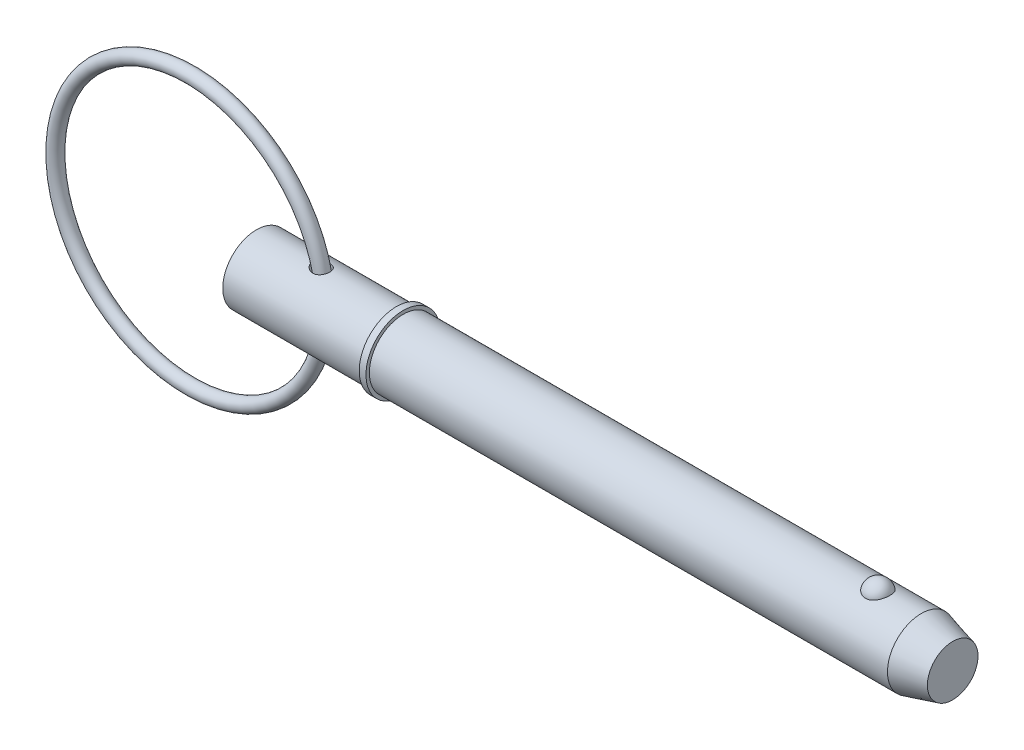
ISO-10303-21;
HEADER;
FILE_DESCRIPTION(('STEP AP214'),'2;1');
FILE_NAME('part.step','',(''),(''),'','','');
FILE_SCHEMA(('AUTOMOTIVE_DESIGN { 1 0 10303 214 1 1 1 1 }'));
ENDSEC;
DATA;
#1=APPLICATION_CONTEXT('core data for automotive mechanical design processes');
#2=APPLICATION_PROTOCOL_DEFINITION('international standard','automotive_design',2000,#1);
#3=PRODUCT_CONTEXT('',#1,'mechanical');
#4=PRODUCT('Part','Part','',(#3));
#5=PRODUCT_RELATED_PRODUCT_CATEGORY('part','',(#4));
#6=PRODUCT_DEFINITION_FORMATION('','',#4);
#7=PRODUCT_DEFINITION_CONTEXT('part definition',#1,'design');
#8=PRODUCT_DEFINITION('design','',#6,#7);
#9=PRODUCT_DEFINITION_SHAPE('','',#8);
#10=(LENGTH_UNIT() NAMED_UNIT(*) SI_UNIT(.MILLI.,.METRE.));
#11=(NAMED_UNIT(*) PLANE_ANGLE_UNIT() SI_UNIT($,.RADIAN.));
#12=(NAMED_UNIT(*) SI_UNIT($,.STERADIAN.) SOLID_ANGLE_UNIT());
#13=UNCERTAINTY_MEASURE_WITH_UNIT(LENGTH_MEASURE(1.E-05),#10,'distance_accuracy_value','');
#14=(GEOMETRIC_REPRESENTATION_CONTEXT(3) GLOBAL_UNCERTAINTY_ASSIGNED_CONTEXT((#13)) GLOBAL_UNIT_ASSIGNED_CONTEXT((#10,
#11,#12)) REPRESENTATION_CONTEXT('',''));
#15=CARTESIAN_POINT('',(0.,0.,0.));
#16=DIRECTION('',(0.,0.,1.));
#17=DIRECTION('',(1.,0.,0.));
#18=AXIS2_PLACEMENT_3D('',#15,#16,#17);
#19=CARTESIAN_POINT('',(-10.8860601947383,0.,0.));
#20=DIRECTION('',(0.,0.,1.));
#21=DIRECTION('',(1.,0.,0.));
#22=AXIS2_PLACEMENT_3D('',#19,#20,#21);
#23=TOROIDAL_SURFACE('',#22,22.225,1.111);
#24=CARTESIAN_POINT('',(12.4499398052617,0.,0.));
#25=VERTEX_POINT('',#24);
#26=VERTEX_LOOP('',#25);
#27=FACE_BOUND('',#26,.T.);
#28=ADVANCED_FACE('P0_F12',(#27),#23,.T.);
#29=CLOSED_SHELL('',(#28));
#30=MANIFOLD_SOLID_BREP('P0_B1',#29);
#31=CARTESIAN_POINT('',(0.,0.,0.));
#32=DIRECTION('',(1.,0.,0.));
#33=DIRECTION('',(0.,0.,-1.));
#34=AXIS2_PLACEMENT_3D('',#31,#32,#33);
#35=CYLINDRICAL_SURFACE('',#34,5.555);
#36=CARTESIAN_POINT('',(9.73108588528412,5.4531967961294,-1.05861687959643));
#37=CARTESIAN_POINT('',(9.79852417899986,5.4428857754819,-1.11173367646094));
#38=CARTESIAN_POINT('',(9.8705426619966,5.43287373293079,-1.15917228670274));
#39=CARTESIAN_POINT('',(10.0216706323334,5.41463354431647,-1.24159548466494));
#40=CARTESIAN_POINT('',(10.100788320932,5.40640749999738,-1.27656543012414));
#41=CARTESIAN_POINT('',(10.2640671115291,5.39277501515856,-1.33298568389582));
#42=CARTESIAN_POINT('',(10.3482338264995,5.38737178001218,-1.35442062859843));
#43=CARTESIAN_POINT('',(10.5191189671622,5.38018930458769,-1.38268153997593));
#44=CARTESIAN_POINT('',(10.6058357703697,5.37840780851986,-1.38951660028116));
#45=CARTESIAN_POINT('',(10.7759121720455,5.37883071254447,-1.38787777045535));
#46=CARTESIAN_POINT('',(10.8592768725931,5.38088957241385,-1.37996287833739));
#47=CARTESIAN_POINT('',(11.0231742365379,5.38856355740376,-1.34968531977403));
#48=CARTESIAN_POINT('',(11.1037078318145,5.39417750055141,-1.3273274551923));
#49=CARTESIAN_POINT('',(11.2542656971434,5.40784427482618,-1.27044672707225));
#50=CARTESIAN_POINT('',(11.3246325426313,5.41571997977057,-1.23678468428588));
#51=CARTESIAN_POINT('',(11.4584043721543,5.43310849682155,-1.15800564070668));
#52=CARTESIAN_POINT('',(11.5218100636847,5.44262114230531,-1.11288980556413));
#53=CARTESIAN_POINT('',(11.6387006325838,5.4619946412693,-1.01348173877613));
#54=CARTESIAN_POINT('',(11.6923567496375,5.47184490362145,-0.959388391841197));
#55=CARTESIAN_POINT('',(11.7899079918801,5.49098914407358,-0.842935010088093));
#56=CARTESIAN_POINT('',(11.8338027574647,5.5002831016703,-0.780574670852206));
#57=CARTESIAN_POINT('',(11.9111930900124,5.51740919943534,-0.648605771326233));
#58=CARTESIAN_POINT('',(11.944571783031,5.52522454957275,-0.578926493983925));
#59=CARTESIAN_POINT('',(11.9994972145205,5.5384271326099,-0.434834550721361));
#60=CARTESIAN_POINT('',(12.0210434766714,5.54381426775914,-0.360421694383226));
#61=CARTESIAN_POINT('',(12.0519313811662,5.55161917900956,-0.208311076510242));
#62=CARTESIAN_POINT('',(12.0611710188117,5.55401212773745,-0.130591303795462));
#63=CARTESIAN_POINT('',(12.0668974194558,5.55548938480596,0.025348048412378));
#64=CARTESIAN_POINT('',(12.0633840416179,5.55457365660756,0.103567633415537));
#65=CARTESIAN_POINT('',(12.0436796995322,5.54953010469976,0.258343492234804));
#66=CARTESIAN_POINT('',(12.0274798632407,5.54540003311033,0.334898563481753));
#67=CARTESIAN_POINT('',(11.9827711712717,5.53437033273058,0.484118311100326));
#68=CARTESIAN_POINT('',(11.9542620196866,5.52747063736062,0.556782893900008));
#69=CARTESIAN_POINT('',(11.8856108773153,5.51165296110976,0.696153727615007));
#70=CARTESIAN_POINT('',(11.8454690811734,5.50273501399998,0.762860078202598));
#71=CARTESIAN_POINT('',(11.7545317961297,5.48386724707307,0.888403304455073));
#72=CARTESIAN_POINT('',(11.7037367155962,5.47391746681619,0.94724048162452));
#73=CARTESIAN_POINT('',(11.5931044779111,5.45416351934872,1.05504470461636));
#74=CARTESIAN_POINT('',(11.533318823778,5.44435885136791,1.10406448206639));
#75=CARTESIAN_POINT('',(11.4061321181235,5.42595363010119,1.19123649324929));
#76=CARTESIAN_POINT('',(11.3387321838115,5.41735290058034,1.22939031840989));
#77=CARTESIAN_POINT('',(11.1991395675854,5.4024225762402,1.29341737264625));
#78=CARTESIAN_POINT('',(11.1270175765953,5.3960658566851,1.3194385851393));
#79=CARTESIAN_POINT('',(10.979323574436,5.38614405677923,1.35937634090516));
#80=CARTESIAN_POINT('',(10.9037515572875,5.38257898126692,1.37329286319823));
#81=CARTESIAN_POINT('',(10.7507722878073,5.37854282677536,1.38901730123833));
#82=CARTESIAN_POINT('',(10.6733560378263,5.37809300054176,1.39074204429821));
#83=CARTESIAN_POINT('',(10.5192388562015,5.38029043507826,1.38221411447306));
#84=CARTESIAN_POINT('',(10.4425381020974,5.38293844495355,1.37195854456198));
#85=CARTESIAN_POINT('',(10.2878936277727,5.39116673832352,1.33926960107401));
#86=CARTESIAN_POINT('',(10.2100819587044,5.3968880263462,1.31624874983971));
#87=CARTESIAN_POINT('',(10.0591420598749,5.4106466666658,1.25849276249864));
#88=CARTESIAN_POINT('',(9.98601576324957,5.41868496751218,1.22375282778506));
#89=CARTESIAN_POINT('',(9.84175565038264,5.43675805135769,1.14087469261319));
#90=CARTESIAN_POINT('',(9.77103801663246,5.44688674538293,1.09202994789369));
#91=CARTESIAN_POINT('',(9.63888287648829,5.46759592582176,0.983100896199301));
#92=CARTESIAN_POINT('',(9.57744762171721,5.47817652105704,0.923013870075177));
#93=CARTESIAN_POINT('',(9.4662044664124,5.49850106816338,0.792984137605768));
#94=CARTESIAN_POINT('',(9.4163677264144,5.5082470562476,0.723066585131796));
#95=CARTESIAN_POINT('',(9.33050546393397,5.52566389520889,0.574973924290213));
#96=CARTESIAN_POINT('',(9.29446727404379,5.53333664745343,0.496806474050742));
#97=CARTESIAN_POINT('',(9.24109888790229,5.54491199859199,0.342579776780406));
#98=CARTESIAN_POINT('',(9.22228936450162,5.54910883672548,0.26705568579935));
#99=CARTESIAN_POINT('',(9.19883437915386,5.55436306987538,0.113748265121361));
#100=CARTESIAN_POINT('',(9.19417820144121,5.55542284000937,0.0359666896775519));
#101=CARTESIAN_POINT('',(9.19905385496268,5.55432298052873,-0.111477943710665));
#102=CARTESIAN_POINT('',(9.20724428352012,5.55246769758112,-0.181191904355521));
#103=CARTESIAN_POINT('',(9.23493000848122,5.54630180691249,-0.318223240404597));
#104=CARTESIAN_POINT('',(9.25442702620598,5.54199082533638,-0.385540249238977));
#105=CARTESIAN_POINT('',(9.30387481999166,5.5313474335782,-0.516280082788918));
#106=CARTESIAN_POINT('',(9.33386163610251,5.52500806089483,-0.579688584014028));
#107=CARTESIAN_POINT('',(9.40305503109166,5.51092599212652,-0.701037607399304));
#108=CARTESIAN_POINT('',(9.44225922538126,5.50318365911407,-0.758979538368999));
#109=CARTESIAN_POINT('',(9.52133732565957,5.48833949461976,-0.859230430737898));
#110=CARTESIAN_POINT('',(9.55998996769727,5.48134889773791,-0.902529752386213));
#111=CARTESIAN_POINT('',(9.64209346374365,5.46725903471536,-0.984288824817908));
#112=CARTESIAN_POINT('',(9.68554534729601,5.46015974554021,-1.02274753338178));
#113=CARTESIAN_POINT('',(9.73108588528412,5.4531967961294,-1.05861687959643));
#114=B_SPLINE_CURVE_WITH_KNOTS('',3,(#36,#37,#38,#39,#40,#41,#42,#43,#44,#45,#46,#47,#48,#49,
#50,#51,#52,#53,#54,#55,#56,#57,#58,#59,#60,#61,#62,#63,#64,#65,#66,#67,#68,#69,#70,#71,#72,#73,
#74,#75,#76,#77,#78,#79,#80,#81,#82,#83,#84,#85,#86,#87,#88,#89,#90,#91,#92,#93,#94,#95,#96,#97,
#98,#99,#100,#101,#102,#103,#104,#105,#106,#107,#108,#109,#110,#111,#112,#113),.UNSPECIFIED.,
.T.,.F.,(4,2,2,2,2,2,2,2,2,2,2,2,2,2,2,2,2,2,2,2,2,2,2,2,2,2,2,2,2,2,2,2,2,2,2,2,2,2,4),(0.,
0.259176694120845,0.518656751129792,0.778430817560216,1.03804303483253,1.28801585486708,
1.53790560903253,1.77195750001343,2.00598558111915,2.23539047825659,2.4648038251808,
2.69668356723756,2.9285726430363,3.16237203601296,3.39617401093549,3.63013963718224,
3.86411088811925,4.09807822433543,4.33203659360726,4.56470246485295,4.79733424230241,
5.02704913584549,5.25676442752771,5.48804534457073,5.71938220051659,5.96237360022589,
6.20546461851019,6.46387943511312,6.72235683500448,6.98018450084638,7.23777490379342,
7.4702968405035,7.70264268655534,7.91229396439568,8.12197716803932,8.33238797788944,
8.54274441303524,8.71772674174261,8.89274668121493),.UNSPECIFIED.);
#115=CARTESIAN_POINT('',(9.73108588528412,5.4531967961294,-1.05861687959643));
#116=VERTEX_POINT('',#115);
#117=EDGE_CURVE('P1_E42',#116,#116,#114,.T.);
#118=ORIENTED_EDGE('',*,*,#117,.T.);
#119=EDGE_LOOP('',(#118));
#120=FACE_BOUND('',#119,.T.);
#121=CARTESIAN_POINT('',(0.,0.,0.));
#122=DIRECTION('',(1.,0.,0.));
#123=DIRECTION('',(0.,0.,-1.));
#124=AXIS2_PLACEMENT_3D('',#121,#122,#123);
#125=CIRCLE('',#124,5.555);
#126=CARTESIAN_POINT('',(0.,0.,-5.555));
#127=VERTEX_POINT('',#126);
#128=EDGE_CURVE('P1_E9',#127,#127,#125,.T.);
#129=ORIENTED_EDGE('',*,*,#128,.T.);
#130=EDGE_LOOP('',(#129));
#131=FACE_BOUND('',#130,.T.);
#132=CARTESIAN_POINT('',(23.019,0.,0.));
#133=DIRECTION('',(1.,0.,0.));
#134=DIRECTION('',(0.,0.,-1.));
#135=AXIS2_PLACEMENT_3D('',#132,#133,#134);
#136=CIRCLE('',#135,5.555);
#137=CARTESIAN_POINT('',(23.019,0.,-5.555));
#138=VERTEX_POINT('',#137);
#139=EDGE_CURVE('P1_E25',#138,#138,#136,.T.);
#140=ORIENTED_EDGE('',*,*,#139,.F.);
#141=EDGE_LOOP('',(#140));
#142=FACE_BOUND('',#141,.T.);
#143=CARTESIAN_POINT('',(9.73108588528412,-5.4531967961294,-1.05861687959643));
#144=CARTESIAN_POINT('',(9.66821110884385,-5.46281068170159,-1.00909184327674));
#145=CARTESIAN_POINT('',(9.60927221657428,-5.47269103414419,-0.954597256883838));
#146=CARTESIAN_POINT('',(9.50103698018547,-5.49196271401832,-0.836622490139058));
#147=CARTESIAN_POINT('',(9.45174193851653,-5.50135397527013,-0.773141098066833));
#148=CARTESIAN_POINT('',(9.36449982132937,-5.51864538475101,-0.638139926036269));
#149=CARTESIAN_POINT('',(9.32660692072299,-5.52653835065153,-0.566583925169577));
#150=CARTESIAN_POINT('',(9.26443740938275,-5.53978685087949,-0.417563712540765));
#151=CARTESIAN_POINT('',(9.24015003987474,-5.54514438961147,-0.34010422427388));
#152=CARTESIAN_POINT('',(9.20806696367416,-5.55228040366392,-0.188389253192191));
#153=CARTESIAN_POINT('',(9.19907227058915,-5.55431849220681,-0.114399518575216));
#154=CARTESIAN_POINT('',(9.19432225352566,-5.55539069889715,0.0340148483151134));
#155=CARTESIAN_POINT('',(9.19856204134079,-5.55442592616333,0.108439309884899));
#156=CARTESIAN_POINT('',(9.21926816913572,-5.54978420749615,0.250226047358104));
#157=CARTESIAN_POINT('',(9.2348766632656,-5.54629766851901,0.31772275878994));
#158=CARTESIAN_POINT('',(9.27656619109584,-5.53719805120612,0.449233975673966));
#159=CARTESIAN_POINT('',(9.3026486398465,-5.53158468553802,0.513248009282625));
#160=CARTESIAN_POINT('',(9.36540111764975,-5.51852259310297,0.63880901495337));
#161=CARTESIAN_POINT('',(9.40244578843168,-5.51101059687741,0.700161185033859));
#162=CARTESIAN_POINT('',(9.48531033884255,-5.49498546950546,0.816463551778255));
#163=CARTESIAN_POINT('',(9.5311337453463,-5.48647193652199,0.871411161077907));
#164=CARTESIAN_POINT('',(9.63549825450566,-5.46826315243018,0.979510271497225));
#165=CARTESIAN_POINT('',(9.69487291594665,-5.4585383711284,1.03185240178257));
#166=CARTESIAN_POINT('',(9.82107706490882,-5.43973797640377,1.12677509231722));
#167=CARTESIAN_POINT('',(9.8879103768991,-5.43066269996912,1.16935061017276));
#168=CARTESIAN_POINT('',(10.033391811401,-5.41336505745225,1.24708757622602));
#169=CARTESIAN_POINT('',(10.1125613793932,-5.40528106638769,1.28130933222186));
#170=CARTESIAN_POINT('',(10.2757060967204,-5.39196874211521,1.3362270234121));
#171=CARTESIAN_POINT('',(10.3596813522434,-5.38674047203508,1.35692265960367));
#172=CARTESIAN_POINT('',(10.5297702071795,-5.37991196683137,1.38375156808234));
#173=CARTESIAN_POINT('',(10.6158742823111,-5.37829778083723,1.38994084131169));
#174=CARTESIAN_POINT('',(10.7878226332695,-5.37901070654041,1.38718250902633));
#175=CARTESIAN_POINT('',(10.8736670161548,-5.38133587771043,1.37824235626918));
#176=CARTESIAN_POINT('',(11.0366214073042,-5.38945418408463,1.34612618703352));
#177=CARTESIAN_POINT('',(11.1139351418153,-5.39501006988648,1.32392147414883));
#178=CARTESIAN_POINT('',(11.2633246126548,-5.40877222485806,1.26652021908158));
#179=CARTESIAN_POINT('',(11.3354015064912,-5.41697790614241,1.23132655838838));
#180=CARTESIAN_POINT('',(11.4690899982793,-5.43466078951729,1.15069817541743));
#181=CARTESIAN_POINT('',(11.5310200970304,-5.4440673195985,1.10577441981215));
#182=CARTESIAN_POINT('',(11.6463540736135,-5.46335537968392,1.0061512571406));
#183=CARTESIAN_POINT('',(11.6997580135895,-5.47323690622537,0.951451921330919));
#184=CARTESIAN_POINT('',(11.7967319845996,-5.49239864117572,0.833747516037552));
#185=CARTESIAN_POINT('',(11.8402908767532,-5.50167816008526,0.770733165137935));
#186=CARTESIAN_POINT('',(11.9164538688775,-5.518621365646,0.638202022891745));
#187=CARTESIAN_POINT('',(11.9490573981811,-5.52628496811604,0.568684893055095));
#188=CARTESIAN_POINT('',(12.0028717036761,-5.53925911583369,0.424207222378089));
#189=CARTESIAN_POINT('',(12.023941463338,-5.54454040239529,0.349191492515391));
#190=CARTESIAN_POINT('',(12.053591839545,-5.55204602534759,0.196582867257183));
#191=CARTESIAN_POINT('',(12.0621722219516,-5.55427030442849,0.118989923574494));
#192=CARTESIAN_POINT('',(12.0666512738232,-5.55542602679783,-0.0368468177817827));
#193=CARTESIAN_POINT('',(12.0625074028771,-5.55434642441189,-0.11509192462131));
#194=CARTESIAN_POINT('',(12.0415418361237,-5.54898613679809,-0.269753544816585));
#195=CARTESIAN_POINT('',(12.0247199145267,-5.54470539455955,-0.346170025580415));
#196=CARTESIAN_POINT('',(11.9787920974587,-5.53340452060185,-0.495008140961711));
#197=CARTESIAN_POINT('',(11.9496857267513,-5.52638428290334,-0.56742962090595));
#198=CARTESIAN_POINT('',(11.8798787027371,-5.51036911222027,-0.706216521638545));
#199=CARTESIAN_POINT('',(11.8391779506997,-5.50137416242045,-0.772581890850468));
#200=CARTESIAN_POINT('',(11.7472553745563,-5.48242167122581,-0.897247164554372));
#201=CARTESIAN_POINT('',(11.6960515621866,-5.47246579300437,-0.955560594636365));
#202=CARTESIAN_POINT('',(11.5843994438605,-5.45270071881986,-1.06256643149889));
#203=CARTESIAN_POINT('',(11.5239521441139,-5.44289150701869,-1.11125988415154));
#204=CARTESIAN_POINT('',(11.396157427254,-5.42463941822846,-1.19717500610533));
#205=CARTESIAN_POINT('',(11.3288903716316,-5.41618309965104,-1.23451335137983));
#206=CARTESIAN_POINT('',(11.1888557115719,-5.40145691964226,-1.29743539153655));
#207=CARTESIAN_POINT('',(11.1160887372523,-5.39518680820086,-1.32302043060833));
#208=CARTESIAN_POINT('',(10.9677009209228,-5.38553131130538,-1.36179181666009));
#209=CARTESIAN_POINT('',(10.8921036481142,-5.38212602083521,-1.3750637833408));
#210=CARTESIAN_POINT('',(10.7396925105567,-5.37842027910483,-1.38948741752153));
#211=CARTESIAN_POINT('',(10.6628784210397,-5.37812040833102,-1.39063681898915));
#212=CARTESIAN_POINT('',(10.5077947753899,-5.38059635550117,-1.38102577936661));
#213=CARTESIAN_POINT('',(10.4295489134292,-5.3834629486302,-1.36991384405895));
#214=CARTESIAN_POINT('',(10.2758428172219,-5.3920092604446,-1.33587599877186));
#215=CARTESIAN_POINT('',(10.2003829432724,-5.39768934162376,-1.31294856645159));
#216=CARTESIAN_POINT('',(10.0559381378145,-5.4110281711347,-1.25682313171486));
#217=CARTESIAN_POINT('',(9.98683368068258,-5.41862962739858,-1.22391777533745));
#218=CARTESIAN_POINT('',(9.85432617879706,-5.43513913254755,-1.14838146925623));
#219=CARTESIAN_POINT('',(9.79092361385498,-5.44404729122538,-1.1057497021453));
#220=CARTESIAN_POINT('',(9.73108588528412,-5.4531967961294,-1.05861687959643));
#221=B_SPLINE_CURVE_WITH_KNOTS('',3,(#143,#144,#145,#146,#147,#148,#149,#150,#151,#152,#153,
#154,#155,#156,#157,#158,#159,#160,#161,#162,#163,#164,#165,#166,#167,#168,#169,#170,#171,#172,
#173,#174,#175,#176,#177,#178,#179,#180,#181,#182,#183,#184,#185,#186,#187,#188,#189,#190,#191,
#192,#193,#194,#195,#196,#197,#198,#199,#200,#201,#202,#203,#204,#205,#206,#207,#208,#209,#210,
#211,#212,#213,#214,#215,#216,#217,#218,#219,#220),.UNSPECIFIED.,.T.,.F.,(4,2,2,2,2,2,2,2,2,2,2,
2,2,2,2,2,2,2,2,2,2,2,2,2,2,2,2,2,2,2,2,2,2,2,2,2,2,2,4),(0.,0.241596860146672,
0.483226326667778,0.725986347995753,0.968554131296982,1.19103755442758,1.41343881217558,
1.62059806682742,1.82778531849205,2.04308674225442,2.25847484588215,2.4967195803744,
2.73508704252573,2.99374644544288,3.25241156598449,3.51007646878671,3.76761448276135,
4.00827541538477,4.24888299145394,4.47904430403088,4.70920393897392,4.93962269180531,
5.17005344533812,5.4032419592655,5.63643484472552,5.87040820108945,6.10438572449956,
6.33837230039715,6.57236086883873,6.80595147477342,7.03951667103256,7.27059385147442,
7.50164459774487,7.73107640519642,7.96055109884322,8.19677907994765,8.43303750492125,
8.66294515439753,8.89287213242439),.UNSPECIFIED.);
#222=CARTESIAN_POINT('',(9.73108588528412,-5.4531967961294,-1.05861687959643));
#223=VERTEX_POINT('',#222);
#224=EDGE_CURVE('P1_E17',#223,#223,#221,.T.);
#225=ORIENTED_EDGE('',*,*,#224,.T.);
#226=EDGE_LOOP('',(#225));
#227=FACE_BOUND('',#226,.T.);
#228=ADVANCED_FACE('P1_F13',(#120,#131,#142,#227),#35,.T.);
#229=CARTESIAN_POINT('',(0.,0.,0.));
#230=DIRECTION('',(1.,0.,0.));
#231=DIRECTION('',(0.,0.,-1.));
#232=AXIS2_PLACEMENT_3D('',#229,#230,#231);
#233=CYLINDRICAL_SURFACE('',#232,5.555);
#234=CARTESIAN_POINT('',(109.417114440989,0.,0.));
#235=DIRECTION('',(1.,0.,0.));
#236=DIRECTION('',(0.,0.,-1.));
#237=AXIS2_PLACEMENT_3D('',#234,#235,#236);
#238=CIRCLE('',#237,5.555);
#239=CARTESIAN_POINT('',(109.417114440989,0.,-5.555));
#240=VERTEX_POINT('',#239);
#241=EDGE_CURVE('P1_E99',#240,#240,#238,.T.);
#242=ORIENTED_EDGE('',*,*,#241,.F.);
#243=EDGE_LOOP('',(#242));
#244=FACE_BOUND('',#243,.T.);
#245=CARTESIAN_POINT('',(24.13,0.,0.));
#246=DIRECTION('',(1.,0.,0.));
#247=DIRECTION('',(0.,0.,-1.));
#248=AXIS2_PLACEMENT_3D('',#245,#246,#247);
#249=CIRCLE('',#248,5.555);
#250=CARTESIAN_POINT('',(24.13,0.,-5.555));
#251=VERTEX_POINT('',#250);
#252=EDGE_CURVE('P1_E96',#251,#251,#249,.T.);
#253=ORIENTED_EDGE('',*,*,#252,.T.);
#254=EDGE_LOOP('',(#253));
#255=FACE_BOUND('',#254,.T.);
#256=CARTESIAN_POINT('',(102.298626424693,5.16741224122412,2.03859650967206));
#257=CARTESIAN_POINT('',(102.192949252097,5.16740893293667,2.03859990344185));
#258=CARTESIAN_POINT('',(102.08729894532,5.17079470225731,2.03008306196));
#259=CARTESIAN_POINT('',(101.879141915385,5.18392795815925,1.99630721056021));
#260=CARTESIAN_POINT('',(101.776634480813,5.19367399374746,1.97105201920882));
#261=CARTESIAN_POINT('',(101.577771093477,5.21839168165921,1.90463997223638));
#262=CARTESIAN_POINT('',(101.481406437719,5.23335573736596,1.86350622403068));
#263=CARTESIAN_POINT('',(101.297080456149,5.26688076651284,1.76652592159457));
#264=CARTESIAN_POINT('',(101.209120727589,5.28544242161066,1.71067657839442));
#265=CARTESIAN_POINT('',(101.041265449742,5.32479845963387,1.58399959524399));
#266=CARTESIAN_POINT('',(100.96166564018,5.34564089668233,1.51279545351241));
#267=CARTESIAN_POINT('',(100.81512901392,5.38697258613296,1.35828584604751));
#268=CARTESIAN_POINT('',(100.748194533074,5.40746177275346,1.27497815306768));
#269=CARTESIAN_POINT('',(100.62561039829,5.44694508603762,1.09440293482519));
#270=CARTESIAN_POINT('',(100.570598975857,5.46583143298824,0.99667783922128));
#271=CARTESIAN_POINT('',(100.476937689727,5.49908030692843,0.792961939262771));
#272=CARTESIAN_POINT('',(100.438289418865,5.513442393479,0.686970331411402));
#273=CARTESIAN_POINT('',(100.377680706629,5.536358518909,0.468019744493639));
#274=CARTESIAN_POINT('',(100.355972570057,5.54482455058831,0.354981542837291));
#275=CARTESIAN_POINT('',(100.330636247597,5.55473324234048,0.126595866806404));
#276=CARTESIAN_POINT('',(100.327007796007,5.55617600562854,0.011248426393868));
#277=CARTESIAN_POINT('',(100.337881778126,5.55189984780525,-0.218011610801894));
#278=CARTESIAN_POINT('',(100.352315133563,5.54620821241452,-0.33192800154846));
#279=CARTESIAN_POINT('',(100.398903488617,5.52828920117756,-0.555544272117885));
#280=CARTESIAN_POINT('',(100.431058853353,5.51606169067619,-0.66524406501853));
#281=CARTESIAN_POINT('',(100.512488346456,5.48630779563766,-0.877469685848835));
#282=CARTESIAN_POINT('',(100.561781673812,5.4687754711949,-0.979987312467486));
#283=CARTESIAN_POINT('',(100.676478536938,5.43024700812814,-1.17486975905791));
#284=CARTESIAN_POINT('',(100.741883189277,5.40925062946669,-1.26723387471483));
#285=CARTESIAN_POINT('',(100.887571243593,5.36600927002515,-1.43940133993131));
#286=CARTESIAN_POINT('',(100.967885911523,5.34376173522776,-1.51917763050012));
#287=CARTESIAN_POINT('',(101.141452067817,5.30057971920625,-1.66360338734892));
#288=CARTESIAN_POINT('',(101.234702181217,5.27964509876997,-1.72825445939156));
#289=CARTESIAN_POINT('',(101.429393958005,5.24205250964,-1.83909478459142));
#290=CARTESIAN_POINT('',(101.530590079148,5.22530519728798,-1.88568407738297));
#291=CARTESIAN_POINT('',(101.740155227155,5.1975091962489,-1.96100802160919));
#292=CARTESIAN_POINT('',(101.848521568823,5.1864583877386,-1.98974931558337));
#293=CARTESIAN_POINT('',(102.063498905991,5.17184410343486,-2.02742262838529));
#294=CARTESIAN_POINT('',(102.169925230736,5.1679328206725,-2.03727608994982));
#295=CARTESIAN_POINT('',(102.382992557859,5.16698995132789,-2.03966777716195));
#296=CARTESIAN_POINT('',(102.489633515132,5.16995704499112,-2.03220932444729));
#297=CARTESIAN_POINT('',(102.696773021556,5.18222383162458,-2.00071170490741));
#298=CARTESIAN_POINT('',(102.797359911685,5.19133213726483,-1.97717337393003));
#299=CARTESIAN_POINT('',(102.993014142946,5.21467637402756,-1.91475248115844));
#300=CARTESIAN_POINT('',(103.088081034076,5.22891272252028,-1.8758686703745));
#301=CARTESIAN_POINT('',(103.272371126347,5.26137066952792,-1.7828271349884));
#302=CARTESIAN_POINT('',(103.361419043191,5.27967329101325,-1.72835124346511));
#303=CARTESIAN_POINT('',(103.529288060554,5.3181741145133,-1.6059748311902));
#304=CARTESIAN_POINT('',(103.608106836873,5.33837274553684,-1.53807126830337));
#305=CARTESIAN_POINT('',(103.757515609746,5.37968287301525,-1.38688970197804));
#306=CARTESIAN_POINT('',(103.827505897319,5.40079011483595,-1.30301744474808));
#307=CARTESIAN_POINT('',(103.953012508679,5.44074401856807,-1.12458170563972));
#308=CARTESIAN_POINT('',(104.008526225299,5.4595902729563,-1.03001630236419));
#309=CARTESIAN_POINT('',(104.105550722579,5.49369849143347,-0.829439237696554));
#310=CARTESIAN_POINT('',(104.146548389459,5.50882422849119,-0.723155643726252));
#311=CARTESIAN_POINT('',(104.211125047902,5.53310911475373,-0.504772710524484));
#312=CARTESIAN_POINT('',(104.234703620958,5.54226812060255,-0.392673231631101));
#313=CARTESIAN_POINT('',(104.264013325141,5.55370358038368,-0.165459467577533));
#314=CARTESIAN_POINT('',(104.269688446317,5.55595843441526,-0.0503368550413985));
#315=CARTESIAN_POINT('',(104.262916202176,5.55329317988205,0.179288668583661));
#316=CARTESIAN_POINT('',(104.250469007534,5.54837313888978,0.29379158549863));
#317=CARTESIAN_POINT('',(104.207779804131,5.53189037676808,0.518526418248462));
#318=CARTESIAN_POINT('',(104.177598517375,5.5203503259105,0.62877154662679));
#319=CARTESIAN_POINT('',(104.100096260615,5.49182453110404,0.842318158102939));
#320=CARTESIAN_POINT('',(104.052774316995,5.47483847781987,0.945619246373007));
#321=CARTESIAN_POINT('',(103.941720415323,5.43710633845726,1.14281571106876));
#322=CARTESIAN_POINT('',(103.877921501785,5.41634501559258,1.23667048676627));
#323=CARTESIAN_POINT('',(103.735357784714,5.37334572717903,1.41185243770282));
#324=CARTESIAN_POINT('',(103.65659323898,5.35110778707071,1.4931798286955));
#325=CARTESIAN_POINT('',(103.486423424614,5.30779474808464,1.64049162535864));
#326=CARTESIAN_POINT('',(103.39510026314,5.28671324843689,1.70656877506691));
#327=CARTESIAN_POINT('',(103.201739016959,5.24804852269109,1.82201372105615));
#328=CARTESIAN_POINT('',(103.099700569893,5.23046541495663,1.87138095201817));
#329=CARTESIAN_POINT('',(102.883618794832,5.20042692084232,1.95335298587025));
#330=CARTESIAN_POINT('',(102.769260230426,5.18820192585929,1.98521734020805));
#331=CARTESIAN_POINT('',(102.536130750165,5.17169804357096,2.02783294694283));
#332=CARTESIAN_POINT('',(102.417361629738,5.16741595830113,2.03859269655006));
#333=CARTESIAN_POINT('',(102.298626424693,5.16741224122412,2.03859650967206));
#334=B_SPLINE_CURVE_WITH_KNOTS('',3,(#256,#257,#258,#259,#260,#261,#262,#263,#264,#265,#266,
#267,#268,#269,#270,#271,#272,#273,#274,#275,#276,#277,#278,#279,#280,#281,#282,#283,#284,#285,
#286,#287,#288,#289,#290,#291,#292,#293,#294,#295,#296,#297,#298,#299,#300,#301,#302,#303,#304,
#305,#306,#307,#308,#309,#310,#311,#312,#313,#314,#315,#316,#317,#318,#319,#320,#321,#322,#323,
#324,#325,#326,#327,#328,#329,#330,#331,#332,#333),.UNSPECIFIED.,.T.,.F.,(4,2,2,2,2,2,2,2,2,2,2,
2,2,2,2,2,2,2,2,2,2,2,2,2,2,2,2,2,2,2,2,2,2,2,2,2,2,2,4),(0.,0.316595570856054,
0.633118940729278,0.949183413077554,1.26530783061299,1.59030762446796,1.91536729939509,
2.25495824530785,2.59458224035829,2.93917283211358,3.28375835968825,3.62703002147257,
3.97030875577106,4.31397329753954,4.65766166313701,5.00207904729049,5.34645984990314,
5.68270547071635,6.01882587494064,6.33808403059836,6.65728093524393,6.96696376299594,
7.27667180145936,7.59321535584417,7.909830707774,8.24210387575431,8.57443684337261,
8.9175589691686,9.2606893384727,9.60489211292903,9.94909164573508,10.2921194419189,
10.6351667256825,10.9796305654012,11.3240884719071,11.6663928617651,12.0087088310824,
12.3645679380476,12.7202837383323),.UNSPECIFIED.);
#335=CARTESIAN_POINT('',(102.298626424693,5.16741224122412,2.03859650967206));
#336=VERTEX_POINT('',#335);
#337=EDGE_CURVE('P1_E34',#336,#336,#334,.T.);
#338=ORIENTED_EDGE('',*,*,#337,.T.);
#339=EDGE_LOOP('',(#338));
#340=FACE_BOUND('',#339,.T.);
#341=ADVANCED_FACE('P1_F46',(#244,#255,#340),#233,.T.);
#342=CARTESIAN_POINT('',(0.,0.,0.));
#343=DIRECTION('',(-1.,0.,0.));
#344=DIRECTION('',(0.,0.,1.));
#345=AXIS2_PLACEMENT_3D('',#342,#343,#344);
#346=PLANE('',#345);
#347=ORIENTED_EDGE('',*,*,#128,.F.);
#348=EDGE_LOOP('',(#347));
#349=FACE_BOUND('',#348,.T.);
#350=ADVANCED_FACE('P1_F15',(#349),#346,.T.);
#351=CARTESIAN_POINT('',(23.019,5.555,0.));
#352=DIRECTION('',(-1.,0.,0.));
#353=DIRECTION('',(0.,0.,1.));
#354=AXIS2_PLACEMENT_3D('',#351,#352,#353);
#355=PLANE('',#354);
#356=ORIENTED_EDGE('',*,*,#139,.T.);
#357=EDGE_LOOP('',(#356));
#358=FACE_BOUND('',#357,.T.);
#359=CARTESIAN_POINT('',(23.019,0.,0.));
#360=DIRECTION('',(1.,0.,0.));
#361=DIRECTION('',(0.,0.,-1.));
#362=AXIS2_PLACEMENT_3D('',#359,#360,#361);
#363=CIRCLE('',#362,6.1105);
#364=CARTESIAN_POINT('',(23.019,0.,-6.1105));
#365=VERTEX_POINT('',#364);
#366=EDGE_CURVE('P1_E30',#365,#365,#363,.T.);
#367=ORIENTED_EDGE('',*,*,#366,.F.);
#368=EDGE_LOOP('',(#367));
#369=FACE_BOUND('',#368,.T.);
#370=ADVANCED_FACE('P1_F81',(#358,#369),#355,.T.);
#371=CARTESIAN_POINT('',(0.,0.,0.));
#372=DIRECTION('',(1.,0.,0.));
#373=DIRECTION('',(0.,0.,-1.));
#374=AXIS2_PLACEMENT_3D('',#371,#372,#373);
#375=CYLINDRICAL_SURFACE('',#374,6.1105);
#376=ORIENTED_EDGE('',*,*,#366,.T.);
#377=EDGE_LOOP('',(#376));
#378=FACE_BOUND('',#377,.T.);
#379=CARTESIAN_POINT('',(24.13,0.,0.));
#380=DIRECTION('',(1.,0.,0.));
#381=DIRECTION('',(0.,0.,-1.));
#382=AXIS2_PLACEMENT_3D('',#379,#380,#381);
#383=CIRCLE('',#382,6.1105);
#384=CARTESIAN_POINT('',(24.13,0.,-6.1105));
#385=VERTEX_POINT('',#384);
#386=EDGE_CURVE('P1_E95',#385,#385,#383,.T.);
#387=ORIENTED_EDGE('',*,*,#386,.F.);
#388=EDGE_LOOP('',(#387));
#389=FACE_BOUND('',#388,.T.);
#390=ADVANCED_FACE('P1_F68',(#378,#389),#375,.T.);
#391=CARTESIAN_POINT('',(24.13,6.1105,0.));
#392=DIRECTION('',(1.,0.,0.));
#393=DIRECTION('',(0.,0.,-1.));
#394=AXIS2_PLACEMENT_3D('',#391,#392,#393);
#395=PLANE('',#394);
#396=ORIENTED_EDGE('',*,*,#386,.T.);
#397=EDGE_LOOP('',(#396));
#398=FACE_BOUND('',#397,.T.);
#399=ORIENTED_EDGE('',*,*,#252,.F.);
#400=EDGE_LOOP('',(#399));
#401=FACE_BOUND('',#400,.T.);
#402=ADVANCED_FACE('P1_F62',(#398,#401),#395,.T.);
#403=CARTESIAN_POINT('',(114.6,0.,0.));
#404=DIRECTION('',(-1.,0.,0.));
#405=DIRECTION('',(0.,0.,1.));
#406=AXIS2_PLACEMENT_3D('',#403,#404,#405);
#407=CONICAL_SURFACE('',#406,4.16625000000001,0.26179938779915);
#408=ORIENTED_EDGE('',*,*,#241,.T.);
#409=EDGE_LOOP('',(#408));
#410=FACE_BOUND('',#409,.T.);
#411=CARTESIAN_POINT('',(114.6,0.,0.));
#412=DIRECTION('',(1.,0.,0.));
#413=DIRECTION('',(0.,0.,-1.));
#414=AXIS2_PLACEMENT_3D('',#411,#412,#413);
#415=CIRCLE('',#414,4.16625000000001);
#416=CARTESIAN_POINT('',(114.6,0.,-4.16625000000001));
#417=VERTEX_POINT('',#416);
#418=EDGE_CURVE('P1_E41',#417,#417,#415,.T.);
#419=ORIENTED_EDGE('',*,*,#418,.F.);
#420=EDGE_LOOP('',(#419));
#421=FACE_BOUND('',#420,.T.);
#422=ADVANCED_FACE('P1_F59',(#410,#421),#407,.T.);
#423=CARTESIAN_POINT('',(114.6,4.16625000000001,0.));
#424=DIRECTION('',(1.,0.,0.));
#425=DIRECTION('',(0.,0.,-1.));
#426=AXIS2_PLACEMENT_3D('',#423,#424,#425);
#427=PLANE('',#426);
#428=ORIENTED_EDGE('',*,*,#418,.T.);
#429=EDGE_LOOP('',(#428));
#430=FACE_BOUND('',#429,.T.);
#431=ADVANCED_FACE('P1_F55',(#430),#427,.T.);
#432=CARTESIAN_POINT('',(102.298626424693,4.99949999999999,0.));
#433=DIRECTION('',(-1.,0.,0.));
#434=DIRECTION('',(0.,1.,0.));
#435=AXIS2_PLACEMENT_3D('',#432,#433,#434);
#436=SPHERICAL_SURFACE('',#435,2.04550000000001);
#437=ORIENTED_EDGE('',*,*,#337,.F.);
#438=EDGE_LOOP('',(#437));
#439=FACE_BOUND('',#438,.T.);
#440=ADVANCED_FACE('P1_F50',(#439),#436,.T.);
#441=CARTESIAN_POINT('',(-10.8860601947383,0.,0.));
#442=DIRECTION('',(0.,0.,1.));
#443=DIRECTION('',(1.,0.,0.));
#444=AXIS2_PLACEMENT_3D('',#441,#442,#443);
#445=TOROIDAL_SURFACE('',#444,22.225,1.38875);
#446=ORIENTED_EDGE('',*,*,#224,.F.);
#447=EDGE_LOOP('',(#446));
#448=FACE_BOUND('',#447,.T.);
#449=ORIENTED_EDGE('',*,*,#117,.F.);
#450=EDGE_LOOP('',(#449));
#451=FACE_BOUND('',#450,.T.);
#452=ADVANCED_FACE('P1_F54',(#448,#451),#445,.F.);
#453=CLOSED_SHELL('',(#228,#341,#350,#370,#390,#402,#422,#431,#440,#452));
#454=MANIFOLD_SOLID_BREP('P1_B1',#453);
#455=ADVANCED_BREP_SHAPE_REPRESENTATION('',(#18,#30,#454),#14);
#456=SHAPE_DEFINITION_REPRESENTATION(#9,#455);
ENDSEC;
END-ISO-10303-21;
